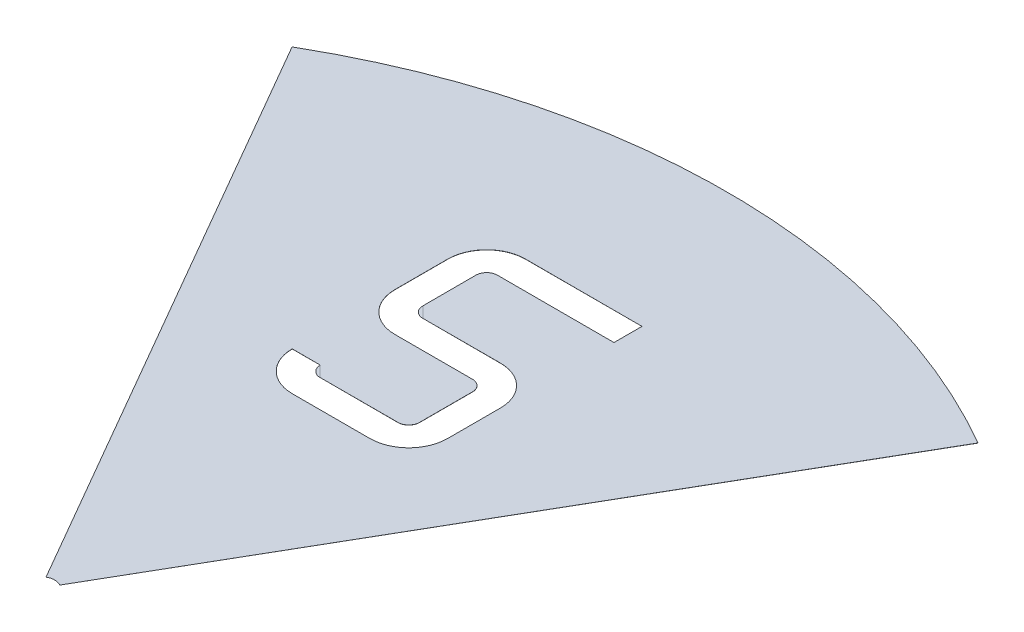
ISO-10303-21;
HEADER;
FILE_DESCRIPTION(('STEP AP214'),'2;1');
FILE_NAME('part.step','',(''),(''),'','','');
FILE_SCHEMA(('AUTOMOTIVE_DESIGN { 1 0 10303 214 1 1 1 1 }'));
ENDSEC;
DATA;
#1=APPLICATION_CONTEXT('core data for automotive mechanical design processes');
#2=APPLICATION_PROTOCOL_DEFINITION('international standard','automotive_design',2000,#1);
#3=PRODUCT_CONTEXT('',#1,'mechanical');
#4=PRODUCT('Part','Part','',(#3));
#5=PRODUCT_RELATED_PRODUCT_CATEGORY('part','',(#4));
#6=PRODUCT_DEFINITION_FORMATION('','',#4);
#7=PRODUCT_DEFINITION_CONTEXT('part definition',#1,'design');
#8=PRODUCT_DEFINITION('design','',#6,#7);
#9=PRODUCT_DEFINITION_SHAPE('','',#8);
#10=(LENGTH_UNIT() NAMED_UNIT(*) SI_UNIT(.MILLI.,.METRE.));
#11=(NAMED_UNIT(*) PLANE_ANGLE_UNIT() SI_UNIT($,.RADIAN.));
#12=(NAMED_UNIT(*) SI_UNIT($,.STERADIAN.) SOLID_ANGLE_UNIT());
#13=UNCERTAINTY_MEASURE_WITH_UNIT(LENGTH_MEASURE(1.E-05),#10,'distance_accuracy_value','');
#14=(GEOMETRIC_REPRESENTATION_CONTEXT(3) GLOBAL_UNCERTAINTY_ASSIGNED_CONTEXT((#13)) GLOBAL_UNIT_ASSIGNED_CONTEXT((#10,
#11,#12)) REPRESENTATION_CONTEXT('',''));
#15=CARTESIAN_POINT('',(0.,0.,0.));
#16=DIRECTION('',(0.,0.,1.));
#17=DIRECTION('',(1.,0.,0.));
#18=AXIS2_PLACEMENT_3D('',#15,#16,#17);
#19=CARTESIAN_POINT('',(-7.58357429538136,-12.0316889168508,12.1826945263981));
#20=DIRECTION('',(0.,1.,0.));
#21=DIRECTION('',(0.,0.,1.));
#22=AXIS2_PLACEMENT_3D('',#19,#20,#21);
#23=PLANE('',#22);
#24=DIRECTION('',(-1.,0.,0.));
#25=VECTOR('',#24,1.);
#26=CARTESIAN_POINT('',(-10.6852133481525,-12.0316889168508,-18.7552632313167));
#27=LINE('',#26,#25);
#28=CARTESIAN_POINT('',(-5.02421334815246,-12.0316889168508,-18.7552632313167));
#29=VERTEX_POINT('',#28);
#30=CARTESIAN_POINT('',(-10.6852133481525,-12.0366889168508,-18.7552632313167));
#31=VERTEX_POINT('',#30);
#32=EDGE_CURVE('E472',#29,#31,#27,.T.);
#33=ORIENTED_EDGE('',*,*,#32,.F.);
#34=CARTESIAN_POINT('',(-5.02421334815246,-12.0316889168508,-15.9247632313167));
#35=DIRECTION('',(0.,1.,0.));
#36=DIRECTION('',(0.,0.,1.));
#37=AXIS2_PLACEMENT_3D('',#34,#35,#36);
#38=CIRCLE('',#37,2.8305);
#39=CARTESIAN_POINT('',(-2.19371334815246,-12.0316889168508,-15.9247632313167));
#40=VERTEX_POINT('',#39);
#41=EDGE_CURVE('E466',#40,#29,#38,.T.);
#42=ORIENTED_EDGE('',*,*,#41,.F.);
#43=DIRECTION('',(0.,0.,-1.));
#44=VECTOR('',#43,1.);
#45=CARTESIAN_POINT('',(-2.19371334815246,-12.0316889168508,-15.9247632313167));
#46=LINE('',#45,#44);
#47=CARTESIAN_POINT('',(-2.19371334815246,-12.0316889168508,-12.0657632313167));
#48=VERTEX_POINT('',#47);
#49=EDGE_CURVE('E500',#48,#40,#46,.T.);
#50=ORIENTED_EDGE('',*,*,#49,.F.);
#51=CARTESIAN_POINT('',(-5.02421334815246,-12.0316889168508,-12.0657632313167));
#52=DIRECTION('',(0.,1.,0.));
#53=DIRECTION('',(0.,0.,1.));
#54=AXIS2_PLACEMENT_3D('',#51,#52,#53);
#55=CIRCLE('',#54,2.8305);
#56=CARTESIAN_POINT('',(-5.02421334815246,-12.0316889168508,-9.23526323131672));
#57=VERTEX_POINT('',#56);
#58=EDGE_CURVE('E494',#57,#48,#55,.T.);
#59=ORIENTED_EDGE('',*,*,#58,.F.);
#60=DIRECTION('',(1.,0.,0.));
#61=VECTOR('',#60,1.);
#62=CARTESIAN_POINT('',(-5.02421334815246,-12.0316889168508,-9.23526323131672));
#63=LINE('',#62,#61);
#64=CARTESIAN_POINT('',(-10.6852133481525,-12.0316889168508,-9.23526323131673));
#65=VERTEX_POINT('',#64);
#66=EDGE_CURVE('E488',#65,#57,#63,.T.);
#67=ORIENTED_EDGE('',*,*,#66,.F.);
#68=CARTESIAN_POINT('',(-10.6852133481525,-12.0316889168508,-12.0657632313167));
#69=DIRECTION('',(0.,1.,0.));
#70=DIRECTION('',(0.,0.,1.));
#71=AXIS2_PLACEMENT_3D('',#68,#69,#70);
#72=CIRCLE('',#71,2.8305);
#73=CARTESIAN_POINT('',(-13.5157133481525,-12.0316889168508,-12.0657632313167));
#74=VERTEX_POINT('',#73);
#75=EDGE_CURVE('E480',#74,#65,#72,.T.);
#76=ORIENTED_EDGE('',*,*,#75,.F.);
#77=DIRECTION('',(-1.,0.,0.));
#78=VECTOR('',#77,1.);
#79=CARTESIAN_POINT('',(-13.5157133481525,-12.0316889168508,-12.0657632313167));
#80=LINE('',#79,#78);
#81=CARTESIAN_POINT('',(-11.4757133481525,-12.0366889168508,-12.0657632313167));
#82=VERTEX_POINT('',#81);
#83=EDGE_CURVE('E475',#82,#74,#80,.T.);
#84=ORIENTED_EDGE('',*,*,#83,.F.);
#85=CARTESIAN_POINT('',(-10.6852133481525,-12.0416889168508,-11.2752632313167));
#86=CARTESIAN_POINT('',(-11.0161490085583,-12.0416889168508,-11.276599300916));
#87=CARTESIAN_POINT('',(-11.2441812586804,-12.0416889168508,-11.5067953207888));
#88=CARTESIAN_POINT('',(-11.4743949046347,-12.0416889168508,-11.7391934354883));
#89=CARTESIAN_POINT('',(-11.4757133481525,-12.0416889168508,-12.0657632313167));
#90=B_SPLINE_CURVE_WITH_KNOTS('',2,(#85,#86,#87,#88,#89),.UNSPECIFIED.,.F.,.F.,(3,2,3),(0.,0.5,
1.),.UNSPECIFIED.);
#91=CARTESIAN_POINT('',(-10.6852133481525,-12.0366889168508,-11.2752632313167));
#92=VERTEX_POINT('',#91);
#93=EDGE_CURVE('E235',#92,#82,#90,.T.);
#94=ORIENTED_EDGE('',*,*,#93,.F.);
#95=DIRECTION('',(-1.,0.,0.));
#96=VECTOR('',#95,1.);
#97=CARTESIAN_POINT('',(-10.6852133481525,-12.0316889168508,-11.2752632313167));
#98=LINE('',#97,#96);
#99=CARTESIAN_POINT('',(-5.02421334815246,-12.0316889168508,-11.2752632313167));
#100=VERTEX_POINT('',#99);
#101=EDGE_CURVE('E427',#100,#92,#98,.T.);
#102=ORIENTED_EDGE('',*,*,#101,.F.);
#103=CARTESIAN_POINT('',(-5.02421334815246,-12.0316889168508,-12.0657632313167));
#104=DIRECTION('',(0.,-1.,0.));
#105=DIRECTION('',(0.,0.,1.));
#106=AXIS2_PLACEMENT_3D('',#103,#104,#105);
#107=CIRCLE('',#106,0.7905);
#108=CARTESIAN_POINT('',(-4.23371334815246,-12.0316889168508,-12.0657632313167));
#109=VERTEX_POINT('',#108);
#110=EDGE_CURVE('E421',#109,#100,#107,.T.);
#111=ORIENTED_EDGE('',*,*,#110,.F.);
#112=DIRECTION('',(0.,0.,1.));
#113=VECTOR('',#112,1.);
#114=CARTESIAN_POINT('',(-4.23371334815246,-12.0316889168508,-12.0657632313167));
#115=LINE('',#114,#113);
#116=CARTESIAN_POINT('',(-4.23371334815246,-12.0316889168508,-15.9247632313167));
#117=VERTEX_POINT('',#116);
#118=EDGE_CURVE('E431',#117,#109,#115,.T.);
#119=ORIENTED_EDGE('',*,*,#118,.F.);
#120=CARTESIAN_POINT('',(-5.02421334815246,-12.0316889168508,-15.9247632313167));
#121=DIRECTION('',(0.,-1.,0.));
#122=DIRECTION('',(0.,0.,1.));
#123=AXIS2_PLACEMENT_3D('',#120,#121,#122);
#124=CIRCLE('',#123,0.7905);
#125=CARTESIAN_POINT('',(-5.02421334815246,-12.0316889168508,-16.7152632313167));
#126=VERTEX_POINT('',#125);
#127=EDGE_CURVE('E436',#126,#117,#124,.T.);
#128=ORIENTED_EDGE('',*,*,#127,.F.);
#129=DIRECTION('',(1.,0.,0.));
#130=VECTOR('',#129,1.);
#131=CARTESIAN_POINT('',(-5.02421334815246,-12.0316889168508,-16.7152632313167));
#132=LINE('',#131,#130);
#133=CARTESIAN_POINT('',(-10.6852133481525,-12.0316889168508,-16.7152632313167));
#134=VERTEX_POINT('',#133);
#135=EDGE_CURVE('E441',#134,#126,#132,.T.);
#136=ORIENTED_EDGE('',*,*,#135,.F.);
#137=CARTESIAN_POINT('',(-10.6852133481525,-12.0316889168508,-19.5457632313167));
#138=DIRECTION('',(0.,1.,0.));
#139=DIRECTION('',(0.,0.,1.));
#140=AXIS2_PLACEMENT_3D('',#137,#138,#139);
#141=CIRCLE('',#140,2.8305);
#142=CARTESIAN_POINT('',(-13.5157133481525,-12.0316889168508,-19.5457632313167));
#143=VERTEX_POINT('',#142);
#144=EDGE_CURVE('E446',#143,#134,#141,.T.);
#145=ORIENTED_EDGE('',*,*,#144,.F.);
#146=DIRECTION('',(0.,0.,1.));
#147=VECTOR('',#146,1.);
#148=CARTESIAN_POINT('',(-13.5157133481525,-12.0316889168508,-19.5457632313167));
#149=LINE('',#148,#147);
#150=CARTESIAN_POINT('',(-13.5157133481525,-12.0316889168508,-23.4047632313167));
#151=VERTEX_POINT('',#150);
#152=EDGE_CURVE('E451',#151,#143,#149,.T.);
#153=ORIENTED_EDGE('',*,*,#152,.F.);
#154=CARTESIAN_POINT('',(-10.6852133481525,-12.0316889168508,-23.4047632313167));
#155=DIRECTION('',(0.,1.,0.));
#156=DIRECTION('',(0.,0.,1.));
#157=AXIS2_PLACEMENT_3D('',#154,#155,#156);
#158=CIRCLE('',#157,2.8305);
#159=CARTESIAN_POINT('',(-10.6852133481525,-12.0316889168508,-26.2352632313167));
#160=VERTEX_POINT('',#159);
#161=EDGE_CURVE('E456',#160,#151,#158,.T.);
#162=ORIENTED_EDGE('',*,*,#161,.F.);
#163=DIRECTION('',(-1.,0.,0.));
#164=VECTOR('',#163,1.);
#165=CARTESIAN_POINT('',(-10.6852133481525,-12.0316889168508,-26.2352632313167));
#166=LINE('',#165,#164);
#167=CARTESIAN_POINT('',(-2.19371334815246,-12.036688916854,-26.2352631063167));
#168=VERTEX_POINT('',#167);
#169=EDGE_CURVE('E453',#168,#160,#166,.T.);
#170=ORIENTED_EDGE('',*,*,#169,.F.);
#171=CARTESIAN_POINT('',(-2.19371334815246,-12.0416889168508,-24.1952632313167));
#172=DIRECTION('',(0.,0.,-1.));
#173=VECTOR('',#172,1.);
#174=LINE('',#171,#173);
#175=CARTESIAN_POINT('',(-2.19371347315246,-12.036688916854,-24.1952632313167));
#176=VERTEX_POINT('',#175);
#177=EDGE_CURVE('E311',#176,#168,#174,.T.);
#178=ORIENTED_EDGE('',*,*,#177,.F.);
#179=DIRECTION('',(1.,0.,0.));
#180=VECTOR('',#179,1.);
#181=CARTESIAN_POINT('',(-2.19371334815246,-12.0316889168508,-24.1952632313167));
#182=LINE('',#181,#180);
#183=CARTESIAN_POINT('',(-10.6852133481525,-12.0316889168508,-24.1952632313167));
#184=VERTEX_POINT('',#183);
#185=EDGE_CURVE('E173',#184,#176,#182,.T.);
#186=ORIENTED_EDGE('',*,*,#185,.F.);
#187=CARTESIAN_POINT('',(-10.6852133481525,-12.0316889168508,-23.4047632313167));
#188=DIRECTION('',(0.,-1.,0.));
#189=DIRECTION('',(0.,0.,1.));
#190=AXIS2_PLACEMENT_3D('',#187,#188,#189);
#191=CIRCLE('',#190,0.7905);
#192=CARTESIAN_POINT('',(-11.4757133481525,-12.0316889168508,-23.4047632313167));
#193=VERTEX_POINT('',#192);
#194=EDGE_CURVE('E170',#193,#184,#191,.T.);
#195=ORIENTED_EDGE('',*,*,#194,.F.);
#196=DIRECTION('',(0.,0.,-1.));
#197=VECTOR('',#196,1.);
#198=CARTESIAN_POINT('',(-11.4757133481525,-12.0316889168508,-23.4047632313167));
#199=LINE('',#198,#197);
#200=CARTESIAN_POINT('',(-11.4757133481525,-12.0366889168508,-19.5457632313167));
#201=VERTEX_POINT('',#200);
#202=EDGE_CURVE('E162',#201,#193,#199,.T.);
#203=ORIENTED_EDGE('',*,*,#202,.F.);
#204=CARTESIAN_POINT('',(-10.6852133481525,-12.0416889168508,-18.7552632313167));
#205=CARTESIAN_POINT('',(-11.0161490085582,-12.0416889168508,-18.756599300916));
#206=CARTESIAN_POINT('',(-11.2441812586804,-12.0416889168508,-18.9867953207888));
#207=CARTESIAN_POINT('',(-11.4743949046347,-12.0416889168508,-19.2191934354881));
#208=CARTESIAN_POINT('',(-11.4757133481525,-12.0416889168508,-19.5457632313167));
#209=B_SPLINE_CURVE_WITH_KNOTS('',2,(#204,#205,#206,#207,#208),.UNSPECIFIED.,.F.,.F.,(3,2,3),
(0.,0.5,1.),.UNSPECIFIED.);
#210=EDGE_CURVE('E167',#31,#201,#209,.T.);
#211=ORIENTED_EDGE('',*,*,#210,.F.);
#212=EDGE_LOOP('',(#33,#42,#50,#59,#67,#76,#84,#94,#102,#111,#119,#128,#136,#145,#153,#162,#170,
#178,#186,#195,#203,#211));
#213=FACE_BOUND('',#212,.T.);
#214=CARTESIAN_POINT('',(-8.08357429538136,-12.0316889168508,11.3166691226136));
#215=CARTESIAN_POINT('',(-7.84857608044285,-12.0316889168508,11.1818850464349));
#216=CARTESIAN_POINT('',(-7.58357429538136,-12.0316889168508,11.1826945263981));
#217=CARTESIAN_POINT('',(-7.31573471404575,-12.0316889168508,11.1835126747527));
#218=CARTESIAN_POINT('',(-7.08357429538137,-12.0316889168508,11.3166691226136));
#219=B_SPLINE_CURVE_WITH_KNOTS('',2,(#214,#215,#216,#217,#218),.UNSPECIFIED.,.F.,.F.,(3,2,3),
(0.,0.5,1.),.UNSPECIFIED.);
#220=CARTESIAN_POINT('',(-8.08357429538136,-12.0366889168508,11.3166691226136));
#221=VERTEX_POINT('',#220);
#222=CARTESIAN_POINT('',(-7.08357429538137,-12.0366889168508,11.3166691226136));
#223=VERTEX_POINT('',#222);
#224=EDGE_CURVE('E26',#221,#223,#219,.T.);
#225=ORIENTED_EDGE('',*,*,#224,.T.);
#226=DIRECTION('',(0.499999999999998,0.,-0.86602540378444));
#227=VECTOR('',#226,1.);
#228=CARTESIAN_POINT('',(-7.08357429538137,-12.0316889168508,11.3166691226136));
#229=LINE('',#228,#227);
#230=CARTESIAN_POINT('',(17.4164257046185,-12.0316889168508,-31.1185756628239));
#231=VERTEX_POINT('',#230);
#232=EDGE_CURVE('E191',#223,#231,#229,.T.);
#233=ORIENTED_EDGE('',*,*,#232,.T.);
#234=CARTESIAN_POINT('',(-7.58357429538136,-12.0316889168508,12.1826945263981));
#235=DIRECTION('',(0.,1.,0.));
#236=DIRECTION('',(0.,0.,1.));
#237=AXIS2_PLACEMENT_3D('',#234,#235,#236);
#238=CIRCLE('',#237,50.);
#239=CARTESIAN_POINT('',(-32.5835742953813,-12.0316889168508,-31.1185756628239));
#240=VERTEX_POINT('',#239);
#241=EDGE_CURVE('E355',#231,#240,#238,.T.);
#242=ORIENTED_EDGE('',*,*,#241,.T.);
#243=DIRECTION('',(0.499999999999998,0.,0.86602540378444));
#244=VECTOR('',#243,1.);
#245=CARTESIAN_POINT('',(-8.08357429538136,-12.0316889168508,11.3166691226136));
#246=LINE('',#245,#244);
#247=EDGE_CURVE('E354',#240,#221,#246,.T.);
#248=ORIENTED_EDGE('',*,*,#247,.T.);
#249=EDGE_LOOP('',(#225,#233,#242,#248));
#250=FACE_BOUND('',#249,.T.);
#251=ADVANCED_FACE('F14',(#213,#250),#23,.T.);
#252=CARTESIAN_POINT('',(-5.02421334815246,-22.0316889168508,-15.9247632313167));
#253=DIRECTION('',(0.,1.,0.));
#254=DIRECTION('',(0.,0.,1.));
#255=AXIS2_PLACEMENT_3D('',#252,#253,#254);
#256=CYLINDRICAL_SURFACE('',#255,2.8305);
#257=DIRECTION('',(0.,1.,0.));
#258=VECTOR('',#257,1.);
#259=CARTESIAN_POINT('',(-2.19371334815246,-22.0316889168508,-15.9247632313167));
#260=LINE('',#259,#258);
#261=CARTESIAN_POINT('',(-2.19371334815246,-12.0416889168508,-15.9247632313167));
#262=VERTEX_POINT('',#261);
#263=EDGE_CURVE('E469',#262,#40,#260,.T.);
#264=ORIENTED_EDGE('',*,*,#263,.T.);
#265=ORIENTED_EDGE('',*,*,#41,.T.);
#266=DIRECTION('',(0.,1.,0.));
#267=VECTOR('',#266,1.);
#268=CARTESIAN_POINT('',(-5.02421334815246,-22.0316889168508,-18.7552632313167));
#269=LINE('',#268,#267);
#270=CARTESIAN_POINT('',(-5.02421334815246,-12.0416889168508,-18.7552632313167));
#271=VERTEX_POINT('',#270);
#272=EDGE_CURVE('E468',#271,#29,#269,.T.);
#273=ORIENTED_EDGE('',*,*,#272,.F.);
#274=CARTESIAN_POINT('',(-2.19371334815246,-12.0416889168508,-15.9247632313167));
#275=CARTESIAN_POINT('',(-2.19376143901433,-12.0416889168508,-16.1849736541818));
#276=CARTESIAN_POINT('',(-2.24096750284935,-12.0416889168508,-16.4398096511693));
#277=CARTESIAN_POINT('',(-2.29122395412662,-12.0416889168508,-16.7111127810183));
#278=CARTESIAN_POINT('',(-2.39244756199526,-12.0416889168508,-16.9666553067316));
#279=CARTESIAN_POINT('',(-2.49831913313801,-12.0416889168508,-17.2339317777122));
#280=CARTESIAN_POINT('',(-2.65509755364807,-12.0416889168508,-17.4736404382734));
#281=CARTESIAN_POINT('',(-2.8158158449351,-12.0416889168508,-17.7193730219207));
#282=CARTESIAN_POINT('',(-3.02274760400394,-12.0416889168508,-17.9262289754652));
#283=CARTESIAN_POINT('',(-3.23040889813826,-12.0416889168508,-18.1338141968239));
#284=CARTESIAN_POINT('',(-3.47533614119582,-12.0416889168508,-18.2938790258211));
#285=CARTESIAN_POINT('',(-3.71598539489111,-12.0416889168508,-18.45114810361));
#286=CARTESIAN_POINT('',(-3.98232127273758,-12.0416889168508,-18.5565290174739));
#287=CARTESIAN_POINT('',(-4.23888642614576,-12.0416889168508,-18.6580439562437));
#288=CARTESIAN_POINT('',(-4.50916692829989,-12.0416889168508,-18.7080090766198));
#289=CARTESIAN_POINT('',(-4.76452315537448,-12.0416889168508,-18.7552152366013));
#290=CARTESIAN_POINT('',(-5.02421334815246,-12.0416889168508,-18.7552632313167));
#291=B_SPLINE_CURVE_WITH_KNOTS('',2,(#274,#275,#276,#277,#278,#279,#280,#281,#282,#283,#284,
#285,#286,#287,#288,#289,#290),.UNSPECIFIED.,.F.,.F.,(3,2,2,2,2,2,2,2,3),(0.,0.125,0.25,0.375,
0.5,0.625,0.75,0.875,1.),.UNSPECIFIED.);
#292=EDGE_CURVE('E550',#262,#271,#291,.T.);
#293=ORIENTED_EDGE('',*,*,#292,.F.);
#294=EDGE_LOOP('',(#264,#265,#273,#293));
#295=FACE_BOUND('',#294,.T.);
#296=ADVANCED_FACE('F205',(#295),#256,.F.);
#297=CARTESIAN_POINT('',(-2.19371334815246,-22.0316889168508,-15.9247632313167));
#298=DIRECTION('',(1.,0.,0.));
#299=DIRECTION('',(0.,0.,-1.));
#300=AXIS2_PLACEMENT_3D('',#297,#298,#299);
#301=PLANE('',#300);
#302=DIRECTION('',(0.,1.,0.));
#303=VECTOR('',#302,1.);
#304=CARTESIAN_POINT('',(-2.19371334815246,-22.0316889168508,-12.0657632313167));
#305=LINE('',#304,#303);
#306=CARTESIAN_POINT('',(-2.19371334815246,-12.0416889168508,-12.0657632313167));
#307=VERTEX_POINT('',#306);
#308=EDGE_CURVE('E503',#307,#48,#305,.T.);
#309=ORIENTED_EDGE('',*,*,#308,.T.);
#310=ORIENTED_EDGE('',*,*,#49,.T.);
#311=ORIENTED_EDGE('',*,*,#263,.F.);
#312=CARTESIAN_POINT('',(-2.19371334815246,-12.0416889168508,-12.0657632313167));
#313=CARTESIAN_POINT('',(-2.19371334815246,-12.0416889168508,-15.9247632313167));
#314=B_SPLINE_CURVE_WITH_KNOTS('',1,(#312,#313),.UNSPECIFIED.,.F.,.F.,(2,2),(0.,1.),.UNSPECIFIED.);
#315=EDGE_CURVE('E560',#307,#262,#314,.T.);
#316=ORIENTED_EDGE('',*,*,#315,.F.);
#317=EDGE_LOOP('',(#309,#310,#311,#316));
#318=FACE_BOUND('',#317,.T.);
#319=ADVANCED_FACE('F812',(#318),#301,.F.);
#320=CARTESIAN_POINT('',(-5.02421334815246,-22.0316889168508,-12.0657632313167));
#321=DIRECTION('',(0.,1.,0.));
#322=DIRECTION('',(0.,0.,1.));
#323=AXIS2_PLACEMENT_3D('',#320,#321,#322);
#324=CYLINDRICAL_SURFACE('',#323,2.8305);
#325=DIRECTION('',(0.,1.,0.));
#326=VECTOR('',#325,1.);
#327=CARTESIAN_POINT('',(-5.02421334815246,-22.0316889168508,-9.23526323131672));
#328=LINE('',#327,#326);
#329=CARTESIAN_POINT('',(-5.02421334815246,-12.0416889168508,-9.23526323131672));
#330=VERTEX_POINT('',#329);
#331=EDGE_CURVE('E497',#330,#57,#328,.T.);
#332=ORIENTED_EDGE('',*,*,#331,.T.);
#333=ORIENTED_EDGE('',*,*,#58,.T.);
#334=ORIENTED_EDGE('',*,*,#308,.F.);
#335=CARTESIAN_POINT('',(-5.02421334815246,-12.0416889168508,-9.23526323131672));
#336=CARTESIAN_POINT('',(-4.7640029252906,-12.0416889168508,-9.23531132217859));
#337=CARTESIAN_POINT('',(-4.50916692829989,-12.0416889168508,-9.28251738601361));
#338=CARTESIAN_POINT('',(-4.23786379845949,-12.0416889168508,-9.33277383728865));
#339=CARTESIAN_POINT('',(-3.98232127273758,-12.0416889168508,-9.43399744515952));
#340=CARTESIAN_POINT('',(-3.71504480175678,-12.0416889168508,-9.53986901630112));
#341=CARTESIAN_POINT('',(-3.47533614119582,-12.0416889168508,-9.69664743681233));
#342=CARTESIAN_POINT('',(-3.22960355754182,-12.0416889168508,-9.85736572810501));
#343=CARTESIAN_POINT('',(-3.02274760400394,-12.0416889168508,-10.0642974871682));
#344=CARTESIAN_POINT('',(-2.81516238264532,-12.0416889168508,-10.2719587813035));
#345=CARTESIAN_POINT('',(-2.65509755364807,-12.0416889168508,-10.5168860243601));
#346=CARTESIAN_POINT('',(-2.49782847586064,-12.0416889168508,-10.7575352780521));
#347=CARTESIAN_POINT('',(-2.39244756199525,-12.0416889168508,-11.0238711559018));
#348=CARTESIAN_POINT('',(-2.29093262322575,-12.0416889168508,-11.2804363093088));
#349=CARTESIAN_POINT('',(-2.24096750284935,-12.0416889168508,-11.5507168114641));
#350=CARTESIAN_POINT('',(-2.19376134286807,-12.0416889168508,-11.8060730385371));
#351=CARTESIAN_POINT('',(-2.19371334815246,-12.0416889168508,-12.0657632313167));
#352=B_SPLINE_CURVE_WITH_KNOTS('',2,(#335,#336,#337,#338,#339,#340,#341,#342,#343,#344,#345,
#346,#347,#348,#349,#350,#351),.UNSPECIFIED.,.F.,.F.,(3,2,2,2,2,2,2,2,3),(0.,0.125,0.25,0.375,
0.5,0.625,0.75,0.875,1.),.UNSPECIFIED.);
#353=EDGE_CURVE('E534',#330,#307,#352,.T.);
#354=ORIENTED_EDGE('',*,*,#353,.F.);
#355=EDGE_LOOP('',(#332,#333,#334,#354));
#356=FACE_BOUND('',#355,.T.);
#357=ADVANCED_FACE('F584',(#356),#324,.F.);
#358=CARTESIAN_POINT('',(-5.02421334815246,-22.0316889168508,-9.23526323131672));
#359=DIRECTION('',(0.,0.,1.));
#360=DIRECTION('',(1.,0.,0.));
#361=AXIS2_PLACEMENT_3D('',#358,#359,#360);
#362=PLANE('',#361);
#363=DIRECTION('',(0.,1.,0.));
#364=VECTOR('',#363,1.);
#365=CARTESIAN_POINT('',(-10.6852133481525,-22.0316889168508,-9.23526323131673));
#366=LINE('',#365,#364);
#367=CARTESIAN_POINT('',(-10.6852133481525,-12.0416889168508,-9.23526323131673));
#368=VERTEX_POINT('',#367);
#369=EDGE_CURVE('E491',#368,#65,#366,.T.);
#370=ORIENTED_EDGE('',*,*,#369,.T.);
#371=ORIENTED_EDGE('',*,*,#66,.T.);
#372=ORIENTED_EDGE('',*,*,#331,.F.);
#373=CARTESIAN_POINT('',(-10.6852133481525,-12.0416889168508,-9.23526323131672));
#374=CARTESIAN_POINT('',(-5.02421334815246,-12.0416889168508,-9.23526323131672));
#375=B_SPLINE_CURVE_WITH_KNOTS('',1,(#373,#374),.UNSPECIFIED.,.F.,.F.,(2,2),(0.,1.),.UNSPECIFIED.);
#376=EDGE_CURVE('E254',#368,#330,#375,.T.);
#377=ORIENTED_EDGE('',*,*,#376,.F.);
#378=EDGE_LOOP('',(#370,#371,#372,#377));
#379=FACE_BOUND('',#378,.T.);
#380=ADVANCED_FACE('F582',(#379),#362,.F.);
#381=CARTESIAN_POINT('',(-10.6852133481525,-22.0316889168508,-12.0657632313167));
#382=DIRECTION('',(0.,1.,0.));
#383=DIRECTION('',(0.,0.,1.));
#384=AXIS2_PLACEMENT_3D('',#381,#382,#383);
#385=CYLINDRICAL_SURFACE('',#384,2.8305);
#386=DIRECTION('',(0.,1.,0.));
#387=VECTOR('',#386,1.);
#388=CARTESIAN_POINT('',(-13.5157133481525,-22.0316889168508,-12.0657632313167));
#389=LINE('',#388,#387);
#390=CARTESIAN_POINT('',(-13.5157133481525,-12.0416889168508,-12.0657632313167));
#391=VERTEX_POINT('',#390);
#392=EDGE_CURVE('E485',#391,#74,#389,.T.);
#393=ORIENTED_EDGE('',*,*,#392,.T.);
#394=ORIENTED_EDGE('',*,*,#75,.T.);
#395=ORIENTED_EDGE('',*,*,#369,.F.);
#396=CARTESIAN_POINT('',(-13.5157133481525,-12.0416889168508,-12.0657632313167));
#397=CARTESIAN_POINT('',(-13.515665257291,-12.0416889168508,-11.8055528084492));
#398=CARTESIAN_POINT('',(-13.4684591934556,-12.0416889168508,-11.5507168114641));
#399=CARTESIAN_POINT('',(-13.4182027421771,-12.0416889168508,-11.2794136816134));
#400=CARTESIAN_POINT('',(-13.3169791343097,-12.0416889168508,-11.0238711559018));
#401=CARTESIAN_POINT('',(-13.2111075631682,-12.0416889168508,-10.756594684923));
#402=CARTESIAN_POINT('',(-13.0543291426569,-12.0416889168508,-10.5168860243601));
#403=CARTESIAN_POINT('',(-12.8936108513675,-12.0416889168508,-10.2711534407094));
#404=CARTESIAN_POINT('',(-12.686679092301,-12.0416889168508,-10.0642974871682));
#405=CARTESIAN_POINT('',(-12.4790177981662,-12.0416889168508,-9.85671226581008));
#406=CARTESIAN_POINT('',(-12.2340905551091,-12.0416889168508,-9.69664743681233));
#407=CARTESIAN_POINT('',(-11.9934413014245,-12.0416889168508,-9.53937835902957));
#408=CARTESIAN_POINT('',(-11.7271054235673,-12.0416889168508,-9.43399744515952));
#409=CARTESIAN_POINT('',(-11.4705402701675,-12.0416889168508,-9.33248250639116));
#410=CARTESIAN_POINT('',(-11.200259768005,-12.0416889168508,-9.28251738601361));
#411=CARTESIAN_POINT('',(-10.9449035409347,-12.0416889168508,-9.23531122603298));
#412=CARTESIAN_POINT('',(-10.6852133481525,-12.0416889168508,-9.23526323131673));
#413=B_SPLINE_CURVE_WITH_KNOTS('',2,(#396,#397,#398,#399,#400,#401,#402,#403,#404,#405,#406,
#407,#408,#409,#410,#411,#412),.UNSPECIFIED.,.F.,.F.,(3,2,2,2,2,2,2,2,3),(0.,0.125,0.25,0.375,
0.5,0.625,0.75,0.875,1.),.UNSPECIFIED.);
#414=EDGE_CURVE('E252',#391,#368,#413,.T.);
#415=ORIENTED_EDGE('',*,*,#414,.F.);
#416=EDGE_LOOP('',(#393,#394,#395,#415));
#417=FACE_BOUND('',#416,.T.);
#418=ADVANCED_FACE('F604',(#417),#385,.F.);
#419=CARTESIAN_POINT('',(-13.5157133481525,-22.0316889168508,-12.0657632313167));
#420=DIRECTION('',(0.,0.,-1.));
#421=DIRECTION('',(-1.,0.,0.));
#422=AXIS2_PLACEMENT_3D('',#419,#420,#421);
#423=PLANE('',#422);
#424=ORIENTED_EDGE('',*,*,#83,.T.);
#425=ORIENTED_EDGE('',*,*,#392,.F.);
#426=CARTESIAN_POINT('',(-11.4757133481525,-12.0416889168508,-12.0657632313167));
#427=CARTESIAN_POINT('',(-13.5157133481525,-12.0416889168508,-12.0657632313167));
#428=B_SPLINE_CURVE_WITH_KNOTS('',1,(#426,#427),.UNSPECIFIED.,.F.,.F.,(2,2),(0.,1.),.UNSPECIFIED.);
#429=EDGE_CURVE('E245',#82,#391,#428,.T.);
#430=ORIENTED_EDGE('',*,*,#429,.F.);
#431=EDGE_LOOP('',(#424,#425,#430));
#432=FACE_BOUND('',#431,.T.);
#433=ADVANCED_FACE('F614',(#432),#423,.F.);
#434=CARTESIAN_POINT('',(-10.6852133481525,-22.0316889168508,-18.7552632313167));
#435=DIRECTION('',(0.,0.,-1.));
#436=DIRECTION('',(-1.,0.,0.));
#437=AXIS2_PLACEMENT_3D('',#434,#435,#436);
#438=PLANE('',#437);
#439=ORIENTED_EDGE('',*,*,#272,.T.);
#440=ORIENTED_EDGE('',*,*,#32,.T.);
#441=CARTESIAN_POINT('',(-5.02421334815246,-12.0416889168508,-18.7552632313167));
#442=CARTESIAN_POINT('',(-10.6852133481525,-12.0416889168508,-18.7552632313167));
#443=B_SPLINE_CURVE_WITH_KNOTS('',1,(#441,#442),.UNSPECIFIED.,.F.,.F.,(2,2),(0.,1.),.UNSPECIFIED.);
#444=EDGE_CURVE('E190',#271,#31,#443,.T.);
#445=ORIENTED_EDGE('',*,*,#444,.F.);
#446=EDGE_LOOP('',(#439,#440,#445));
#447=FACE_BOUND('',#446,.T.);
#448=ADVANCED_FACE('F618',(#447),#438,.F.);
#449=CARTESIAN_POINT('',(-10.6852133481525,-22.0316889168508,-23.4047632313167));
#450=DIRECTION('',(0.,1.,0.));
#451=DIRECTION('',(0.,0.,1.));
#452=AXIS2_PLACEMENT_3D('',#449,#450,#451);
#453=CYLINDRICAL_SURFACE('',#452,2.8305);
#454=DIRECTION('',(0.,1.,0.));
#455=VECTOR('',#454,1.);
#456=CARTESIAN_POINT('',(-10.6852133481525,-22.0316889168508,-26.2352632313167));
#457=LINE('',#456,#455);
#458=CARTESIAN_POINT('',(-10.6852133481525,-12.0416889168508,-26.2352632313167));
#459=VERTEX_POINT('',#458);
#460=EDGE_CURVE('E459',#459,#160,#457,.T.);
#461=ORIENTED_EDGE('',*,*,#460,.T.);
#462=ORIENTED_EDGE('',*,*,#161,.T.);
#463=DIRECTION('',(0.,1.,0.));
#464=VECTOR('',#463,1.);
#465=CARTESIAN_POINT('',(-13.5157133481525,-22.0316889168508,-23.4047632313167));
#466=LINE('',#465,#464);
#467=CARTESIAN_POINT('',(-13.5157133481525,-12.0416889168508,-23.4047632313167));
#468=VERTEX_POINT('',#467);
#469=EDGE_CURVE('E458',#468,#151,#466,.T.);
#470=ORIENTED_EDGE('',*,*,#469,.F.);
#471=CARTESIAN_POINT('',(-10.6852133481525,-12.0416889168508,-26.2352632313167));
#472=CARTESIAN_POINT('',(-10.9454237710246,-12.0416889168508,-26.2352151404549));
#473=CARTESIAN_POINT('',(-11.200259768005,-12.0416889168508,-26.1880090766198));
#474=CARTESIAN_POINT('',(-11.47156289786,-12.0416889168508,-26.1377526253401));
#475=CARTESIAN_POINT('',(-11.7271054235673,-12.0416889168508,-26.0365290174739));
#476=CARTESIAN_POINT('',(-11.9943818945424,-12.0416889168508,-25.9306574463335));
#477=CARTESIAN_POINT('',(-12.2340905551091,-12.0416889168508,-25.7738790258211));
#478=CARTESIAN_POINT('',(-12.4798231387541,-12.0416889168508,-25.613160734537));
#479=CARTESIAN_POINT('',(-12.686679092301,-12.0416889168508,-25.4062289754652));
#480=CARTESIAN_POINT('',(-12.8942643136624,-12.0416889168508,-25.1985676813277));
#481=CARTESIAN_POINT('',(-13.0543291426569,-12.0416889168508,-24.9536404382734));
#482=CARTESIAN_POINT('',(-13.2115982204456,-12.0416889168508,-24.7129911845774));
#483=CARTESIAN_POINT('',(-13.3169791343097,-12.0416889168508,-24.4466553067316));
#484=CARTESIAN_POINT('',(-13.4184940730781,-12.0416889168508,-24.1900901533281));
#485=CARTESIAN_POINT('',(-13.4684591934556,-12.0416889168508,-23.9198096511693));
#486=CARTESIAN_POINT('',(-13.5156653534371,-12.0416889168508,-23.6644534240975));
#487=CARTESIAN_POINT('',(-13.5157133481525,-12.0416889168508,-23.4047632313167));
#488=B_SPLINE_CURVE_WITH_KNOTS('',2,(#471,#472,#473,#474,#475,#476,#477,#478,#479,#480,#481,
#482,#483,#484,#485,#486,#487),.UNSPECIFIED.,.F.,.F.,(3,2,2,2,2,2,2,2,3),(0.,0.125,0.25,0.375,
0.5,0.625,0.75,0.875,1.),.UNSPECIFIED.);
#489=EDGE_CURVE('E300',#459,#468,#488,.T.);
#490=ORIENTED_EDGE('',*,*,#489,.F.);
#491=EDGE_LOOP('',(#461,#462,#470,#490));
#492=FACE_BOUND('',#491,.T.);
#493=ADVANCED_FACE('F622',(#492),#453,.F.);
#494=CARTESIAN_POINT('',(-10.6852133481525,-22.0316889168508,-26.2352632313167));
#495=DIRECTION('',(0.,0.,-1.));
#496=DIRECTION('',(-1.,0.,0.));
#497=AXIS2_PLACEMENT_3D('',#494,#495,#496);
#498=PLANE('',#497);
#499=ORIENTED_EDGE('',*,*,#169,.T.);
#500=ORIENTED_EDGE('',*,*,#460,.F.);
#501=CARTESIAN_POINT('',(-2.19371334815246,-12.0416889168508,-26.2352632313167));
#502=CARTESIAN_POINT('',(-10.6852133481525,-12.0416889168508,-26.2352632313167));
#503=B_SPLINE_CURVE_WITH_KNOTS('',1,(#501,#502),.UNSPECIFIED.,.F.,.F.,(2,2),(0.,1.),.UNSPECIFIED.);
#504=EDGE_CURVE('E305',#168,#459,#503,.T.);
#505=ORIENTED_EDGE('',*,*,#504,.F.);
#506=EDGE_LOOP('',(#499,#500,#505));
#507=FACE_BOUND('',#506,.T.);
#508=ADVANCED_FACE('F627',(#507),#498,.F.);
#509=CARTESIAN_POINT('',(-13.5157133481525,-22.0316889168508,-19.5457632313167));
#510=DIRECTION('',(-1.,0.,0.));
#511=DIRECTION('',(0.,0.,1.));
#512=AXIS2_PLACEMENT_3D('',#509,#510,#511);
#513=PLANE('',#512);
#514=ORIENTED_EDGE('',*,*,#469,.T.);
#515=ORIENTED_EDGE('',*,*,#152,.T.);
#516=DIRECTION('',(0.,1.,0.));
#517=VECTOR('',#516,1.);
#518=CARTESIAN_POINT('',(-13.5157133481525,-22.0316889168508,-19.5457632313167));
#519=LINE('',#518,#517);
#520=CARTESIAN_POINT('',(-13.5157133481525,-12.0416889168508,-19.5457632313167));
#521=VERTEX_POINT('',#520);
#522=EDGE_CURVE('E448',#521,#143,#519,.T.);
#523=ORIENTED_EDGE('',*,*,#522,.F.);
#524=CARTESIAN_POINT('',(-13.5157133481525,-12.0416889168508,-23.4047632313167));
#525=CARTESIAN_POINT('',(-13.5157133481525,-12.0416889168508,-19.5457632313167));
#526=B_SPLINE_CURVE_WITH_KNOTS('',1,(#524,#525),.UNSPECIFIED.,.F.,.F.,(2,2),(0.,1.),.UNSPECIFIED.);
#527=EDGE_CURVE('E294',#468,#521,#526,.T.);
#528=ORIENTED_EDGE('',*,*,#527,.F.);
#529=EDGE_LOOP('',(#514,#515,#523,#528));
#530=FACE_BOUND('',#529,.T.);
#531=ADVANCED_FACE('F679',(#530),#513,.F.);
#532=CARTESIAN_POINT('',(-10.6852133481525,-22.0316889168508,-19.5457632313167));
#533=DIRECTION('',(0.,1.,0.));
#534=DIRECTION('',(0.,0.,1.));
#535=AXIS2_PLACEMENT_3D('',#532,#533,#534);
#536=CYLINDRICAL_SURFACE('',#535,2.8305);
#537=ORIENTED_EDGE('',*,*,#522,.T.);
#538=ORIENTED_EDGE('',*,*,#144,.T.);
#539=DIRECTION('',(0.,1.,0.));
#540=VECTOR('',#539,1.);
#541=CARTESIAN_POINT('',(-10.6852133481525,-22.0316889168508,-16.7152632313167));
#542=LINE('',#541,#540);
#543=CARTESIAN_POINT('',(-10.6852133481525,-12.0416889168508,-16.7152632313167));
#544=VERTEX_POINT('',#543);
#545=EDGE_CURVE('E443',#544,#134,#542,.T.);
#546=ORIENTED_EDGE('',*,*,#545,.F.);
#547=CARTESIAN_POINT('',(-13.5157133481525,-12.0416889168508,-19.5457632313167));
#548=CARTESIAN_POINT('',(-13.515665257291,-12.0416889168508,-19.2855528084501));
#549=CARTESIAN_POINT('',(-13.4684591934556,-12.0416889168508,-19.0307168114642));
#550=CARTESIAN_POINT('',(-13.4182027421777,-12.0416889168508,-18.7594136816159));
#551=CARTESIAN_POINT('',(-13.3169791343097,-12.0416889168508,-18.5038711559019));
#552=CARTESIAN_POINT('',(-13.2111075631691,-12.0416889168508,-18.2365946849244));
#553=CARTESIAN_POINT('',(-13.0543291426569,-12.0416889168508,-17.9968860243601));
#554=CARTESIAN_POINT('',(-12.8936108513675,-12.0416889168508,-17.7511534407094));
#555=CARTESIAN_POINT('',(-12.686679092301,-12.0416889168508,-17.5442974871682));
#556=CARTESIAN_POINT('',(-12.4790177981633,-12.0416889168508,-17.3367122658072));
#557=CARTESIAN_POINT('',(-12.2340905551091,-12.0416889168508,-17.1766474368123));
#558=CARTESIAN_POINT('',(-11.9934413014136,-12.0416889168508,-17.0193783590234));
#559=CARTESIAN_POINT('',(-11.7271054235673,-12.0416889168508,-16.9139974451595));
#560=CARTESIAN_POINT('',(-11.4705402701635,-12.0416889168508,-16.8124825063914));
#561=CARTESIAN_POINT('',(-11.200259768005,-12.0416889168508,-16.7625173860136));
#562=CARTESIAN_POINT('',(-10.9449035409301,-12.0416889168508,-16.7153112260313));
#563=CARTESIAN_POINT('',(-10.6852133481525,-12.0416889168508,-16.7152632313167));
#564=B_SPLINE_CURVE_WITH_KNOTS('',2,(#547,#548,#549,#550,#551,#552,#553,#554,#555,#556,#557,
#558,#559,#560,#561,#562,#563),.UNSPECIFIED.,.F.,.F.,(3,2,2,2,2,2,2,2,3),(0.,0.125,0.25,0.375,
0.5,0.625,0.75,0.875,1.),.UNSPECIFIED.);
#565=EDGE_CURVE('E289',#521,#544,#564,.T.);
#566=ORIENTED_EDGE('',*,*,#565,.F.);
#567=EDGE_LOOP('',(#537,#538,#546,#566));
#568=FACE_BOUND('',#567,.T.);
#569=ADVANCED_FACE('F669',(#568),#536,.F.);
#570=CARTESIAN_POINT('',(-5.02421334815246,-22.0316889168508,-16.7152632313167));
#571=DIRECTION('',(0.,0.,1.));
#572=DIRECTION('',(1.,0.,0.));
#573=AXIS2_PLACEMENT_3D('',#570,#571,#572);
#574=PLANE('',#573);
#575=ORIENTED_EDGE('',*,*,#545,.T.);
#576=ORIENTED_EDGE('',*,*,#135,.T.);
#577=DIRECTION('',(0.,1.,0.));
#578=VECTOR('',#577,1.);
#579=CARTESIAN_POINT('',(-5.02421334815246,-22.0316889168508,-16.7152632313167));
#580=LINE('',#579,#578);
#581=CARTESIAN_POINT('',(-5.02421334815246,-12.0416889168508,-16.7152632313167));
#582=VERTEX_POINT('',#581);
#583=EDGE_CURVE('E438',#582,#126,#580,.T.);
#584=ORIENTED_EDGE('',*,*,#583,.F.);
#585=CARTESIAN_POINT('',(-10.6852133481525,-12.0416889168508,-16.7152632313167));
#586=CARTESIAN_POINT('',(-5.02421334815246,-12.0416889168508,-16.7152632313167));
#587=B_SPLINE_CURVE_WITH_KNOTS('',1,(#585,#586),.UNSPECIFIED.,.F.,.F.,(2,2),(0.,1.),.UNSPECIFIED.);
#588=EDGE_CURVE('E283',#544,#582,#587,.T.);
#589=ORIENTED_EDGE('',*,*,#588,.F.);
#590=EDGE_LOOP('',(#575,#576,#584,#589));
#591=FACE_BOUND('',#590,.T.);
#592=ADVANCED_FACE('F678',(#591),#574,.F.);
#593=CARTESIAN_POINT('',(-5.02421334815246,-22.0316889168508,-15.9247632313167));
#594=DIRECTION('',(0.,1.,0.));
#595=DIRECTION('',(0.,0.,1.));
#596=AXIS2_PLACEMENT_3D('',#593,#594,#595);
#597=CYLINDRICAL_SURFACE('',#596,0.7905);
#598=ORIENTED_EDGE('',*,*,#583,.T.);
#599=ORIENTED_EDGE('',*,*,#127,.T.);
#600=DIRECTION('',(0.,1.,0.));
#601=VECTOR('',#600,1.);
#602=CARTESIAN_POINT('',(-4.23371334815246,-22.0316889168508,-15.9247632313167));
#603=LINE('',#602,#601);
#604=CARTESIAN_POINT('',(-4.23371334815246,-12.0416889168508,-15.9247632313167));
#605=VERTEX_POINT('',#604);
#606=EDGE_CURVE('E433',#605,#117,#603,.T.);
#607=ORIENTED_EDGE('',*,*,#606,.F.);
#608=CARTESIAN_POINT('',(-5.02421334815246,-12.0416889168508,-15.9247632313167));
#609=DIRECTION('',(0.,1.,0.));
#610=DIRECTION('',(1.,0.,0.));
#611=AXIS2_PLACEMENT_3D('',#608,#609,#610);
#612=CIRCLE('',#611,0.7905);
#613=EDGE_CURVE('E278',#605,#582,#612,.T.);
#614=ORIENTED_EDGE('',*,*,#613,.T.);
#615=EDGE_LOOP('',(#598,#599,#607,#614));
#616=FACE_BOUND('',#615,.T.);
#617=ADVANCED_FACE('F682',(#616),#597,.T.);
#618=CARTESIAN_POINT('',(-4.23371334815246,-22.0316889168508,-12.0657632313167));
#619=DIRECTION('',(-1.,0.,0.));
#620=DIRECTION('',(0.,0.,1.));
#621=AXIS2_PLACEMENT_3D('',#618,#619,#620);
#622=PLANE('',#621);
#623=ORIENTED_EDGE('',*,*,#606,.T.);
#624=ORIENTED_EDGE('',*,*,#118,.T.);
#625=DIRECTION('',(0.,1.,0.));
#626=VECTOR('',#625,1.);
#627=CARTESIAN_POINT('',(-4.23371334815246,-22.0316889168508,-12.0657632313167));
#628=LINE('',#627,#626);
#629=CARTESIAN_POINT('',(-4.23371334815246,-12.0416889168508,-12.0657632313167));
#630=VERTEX_POINT('',#629);
#631=EDGE_CURVE('E424',#630,#109,#628,.T.);
#632=ORIENTED_EDGE('',*,*,#631,.F.);
#633=CARTESIAN_POINT('',(-4.23371334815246,-12.0416889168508,-15.9247632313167));
#634=CARTESIAN_POINT('',(-4.23371334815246,-12.0416889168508,-12.0657632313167));
#635=B_SPLINE_CURVE_WITH_KNOTS('',1,(#633,#634),.UNSPECIFIED.,.F.,.F.,(2,2),(0.,1.),.UNSPECIFIED.);
#636=EDGE_CURVE('E272',#605,#630,#635,.T.);
#637=ORIENTED_EDGE('',*,*,#636,.F.);
#638=EDGE_LOOP('',(#623,#624,#632,#637));
#639=FACE_BOUND('',#638,.T.);
#640=ADVANCED_FACE('F687',(#639),#622,.F.);
#641=CARTESIAN_POINT('',(-5.02421334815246,-22.0316889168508,-12.0657632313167));
#642=DIRECTION('',(0.,1.,0.));
#643=DIRECTION('',(0.,0.,1.));
#644=AXIS2_PLACEMENT_3D('',#641,#642,#643);
#645=CYLINDRICAL_SURFACE('',#644,0.7905);
#646=ORIENTED_EDGE('',*,*,#631,.T.);
#647=ORIENTED_EDGE('',*,*,#110,.T.);
#648=DIRECTION('',(0.,1.,0.));
#649=VECTOR('',#648,1.);
#650=CARTESIAN_POINT('',(-5.02421334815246,-22.0316889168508,-11.2752632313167));
#651=LINE('',#650,#649);
#652=CARTESIAN_POINT('',(-5.02421334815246,-12.0416889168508,-11.2752632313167));
#653=VERTEX_POINT('',#652);
#654=EDGE_CURVE('E423',#653,#100,#651,.T.);
#655=ORIENTED_EDGE('',*,*,#654,.F.);
#656=CARTESIAN_POINT('',(-5.02421334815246,-12.0416889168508,-12.0657632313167));
#657=DIRECTION('',(0.,1.,0.));
#658=DIRECTION('',(0.,0.,1.));
#659=AXIS2_PLACEMENT_3D('',#656,#657,#658);
#660=CIRCLE('',#659,0.7905);
#661=EDGE_CURVE('E250',#653,#630,#660,.T.);
#662=ORIENTED_EDGE('',*,*,#661,.T.);
#663=EDGE_LOOP('',(#646,#647,#655,#662));
#664=FACE_BOUND('',#663,.T.);
#665=ADVANCED_FACE('F727',(#664),#645,.T.);
#666=CARTESIAN_POINT('',(-10.6852133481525,-22.0316889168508,-11.2752632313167));
#667=DIRECTION('',(0.,0.,-1.));
#668=DIRECTION('',(-1.,0.,0.));
#669=AXIS2_PLACEMENT_3D('',#666,#667,#668);
#670=PLANE('',#669);
#671=ORIENTED_EDGE('',*,*,#654,.T.);
#672=ORIENTED_EDGE('',*,*,#101,.T.);
#673=CARTESIAN_POINT('',(-5.02421334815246,-12.0416889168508,-11.2752632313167));
#674=CARTESIAN_POINT('',(-10.6852133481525,-12.0416889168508,-11.2752632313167));
#675=B_SPLINE_CURVE_WITH_KNOTS('',1,(#673,#674),.UNSPECIFIED.,.F.,.F.,(2,2),(0.,1.),.UNSPECIFIED.);
#676=EDGE_CURVE('E248',#653,#92,#675,.T.);
#677=ORIENTED_EDGE('',*,*,#676,.F.);
#678=EDGE_LOOP('',(#671,#672,#677));
#679=FACE_BOUND('',#678,.T.);
#680=ADVANCED_FACE('F736',(#679),#670,.F.);
#681=CARTESIAN_POINT('',(-10.6852133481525,-22.0316889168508,-23.4047632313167));
#682=DIRECTION('',(0.,1.,0.));
#683=DIRECTION('',(0.,0.,1.));
#684=AXIS2_PLACEMENT_3D('',#681,#682,#683);
#685=CYLINDRICAL_SURFACE('',#684,0.7905);
#686=DIRECTION('',(0.,1.,0.));
#687=VECTOR('',#686,1.);
#688=CARTESIAN_POINT('',(-11.4757133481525,-22.0316889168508,-23.4047632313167));
#689=LINE('',#688,#687);
#690=CARTESIAN_POINT('',(-11.4757133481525,-12.0416889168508,-23.4047632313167));
#691=VERTEX_POINT('',#690);
#692=EDGE_CURVE('E179',#691,#193,#689,.T.);
#693=ORIENTED_EDGE('',*,*,#692,.T.);
#694=ORIENTED_EDGE('',*,*,#194,.T.);
#695=DIRECTION('',(0.,1.,0.));
#696=VECTOR('',#695,1.);
#697=CARTESIAN_POINT('',(-10.6852133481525,-22.0316889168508,-24.1952632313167));
#698=LINE('',#697,#696);
#699=CARTESIAN_POINT('',(-10.6852133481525,-12.0416889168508,-24.1952632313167));
#700=VERTEX_POINT('',#699);
#701=EDGE_CURVE('E174',#700,#184,#698,.T.);
#702=ORIENTED_EDGE('',*,*,#701,.F.);
#703=CARTESIAN_POINT('',(-10.6852133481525,-12.0416889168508,-23.4047632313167));
#704=DIRECTION('',(0.,1.,0.));
#705=DIRECTION('',(0.,0.,-1.));
#706=AXIS2_PLACEMENT_3D('',#703,#704,#705);
#707=CIRCLE('',#706,0.7905);
#708=EDGE_CURVE('E184',#700,#691,#707,.T.);
#709=ORIENTED_EDGE('',*,*,#708,.T.);
#710=EDGE_LOOP('',(#693,#694,#702,#709));
#711=FACE_BOUND('',#710,.T.);
#712=ADVANCED_FACE('F739',(#711),#685,.T.);
#713=CARTESIAN_POINT('',(-11.4757133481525,-22.0316889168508,-23.4047632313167));
#714=DIRECTION('',(1.,0.,0.));
#715=DIRECTION('',(0.,0.,-1.));
#716=AXIS2_PLACEMENT_3D('',#713,#714,#715);
#717=PLANE('',#716);
#718=ORIENTED_EDGE('',*,*,#202,.T.);
#719=ORIENTED_EDGE('',*,*,#692,.F.);
#720=CARTESIAN_POINT('',(-11.4757133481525,-12.0416889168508,-19.5457632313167));
#721=CARTESIAN_POINT('',(-11.4757133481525,-12.0416889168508,-23.4047632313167));
#722=B_SPLINE_CURVE_WITH_KNOTS('',1,(#720,#721),.UNSPECIFIED.,.F.,.F.,(2,2),(0.,1.),.UNSPECIFIED.);
#723=EDGE_CURVE('E177',#201,#691,#722,.T.);
#724=ORIENTED_EDGE('',*,*,#723,.F.);
#725=EDGE_LOOP('',(#718,#719,#724));
#726=FACE_BOUND('',#725,.T.);
#727=ADVANCED_FACE('F178',(#726),#717,.F.);
#728=CARTESIAN_POINT('',(-2.19371334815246,-22.0316889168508,-24.1952632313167));
#729=DIRECTION('',(0.,0.,1.));
#730=DIRECTION('',(1.,0.,0.));
#731=AXIS2_PLACEMENT_3D('',#728,#729,#730);
#732=PLANE('',#731);
#733=ORIENTED_EDGE('',*,*,#701,.T.);
#734=ORIENTED_EDGE('',*,*,#185,.T.);
#735=CARTESIAN_POINT('',(-10.6852133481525,-12.0416889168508,-24.1952632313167));
#736=CARTESIAN_POINT('',(-2.19371334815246,-12.0416889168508,-24.1952632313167));
#737=B_SPLINE_CURVE_WITH_KNOTS('',1,(#735,#736),.UNSPECIFIED.,.F.,.F.,(2,2),(0.,1.),.UNSPECIFIED.);
#738=EDGE_CURVE('E316',#700,#176,#737,.T.);
#739=ORIENTED_EDGE('',*,*,#738,.F.);
#740=EDGE_LOOP('',(#733,#734,#739));
#741=FACE_BOUND('',#740,.T.);
#742=ADVANCED_FACE('F381',(#741),#732,.F.);
#743=CARTESIAN_POINT('',(-7.58357429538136,-12.0316889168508,12.1826945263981));
#744=DIRECTION('',(0.,-1.,0.));
#745=DIRECTION('',(0.,0.,-1.));
#746=AXIS2_PLACEMENT_3D('',#743,#744,#745);
#747=CYLINDRICAL_SURFACE('',#746,50.);
#748=CARTESIAN_POINT('',(-7.58357429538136,-12.0416889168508,12.1826945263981));
#749=DIRECTION('',(0.,1.,0.));
#750=DIRECTION('',(0.499999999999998,0.,-0.86602540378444));
#751=AXIS2_PLACEMENT_3D('',#748,#749,#750);
#752=CIRCLE('',#751,50.);
#753=CARTESIAN_POINT('',(17.4164257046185,-12.0416889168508,-31.1185756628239));
#754=VERTEX_POINT('',#753);
#755=CARTESIAN_POINT('',(-32.5835742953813,-12.0416889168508,-31.1185756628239));
#756=VERTEX_POINT('',#755);
#757=EDGE_CURVE('E183',#754,#756,#752,.T.);
#758=ORIENTED_EDGE('',*,*,#757,.T.);
#759=DIRECTION('',(0.,-1.,0.));
#760=VECTOR('',#759,1.);
#761=CARTESIAN_POINT('',(-32.5835742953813,-12.0316889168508,-31.1185756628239));
#762=LINE('',#761,#760);
#763=EDGE_CURVE('E358',#240,#756,#762,.T.);
#764=ORIENTED_EDGE('',*,*,#763,.F.);
#765=ORIENTED_EDGE('',*,*,#241,.F.);
#766=DIRECTION('',(0.,-1.,0.));
#767=VECTOR('',#766,1.);
#768=CARTESIAN_POINT('',(17.4164257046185,-12.0316889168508,-31.1185756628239));
#769=LINE('',#768,#767);
#770=EDGE_CURVE('E35',#231,#754,#769,.T.);
#771=ORIENTED_EDGE('',*,*,#770,.T.);
#772=EDGE_LOOP('',(#758,#764,#765,#771));
#773=FACE_BOUND('',#772,.T.);
#774=ADVANCED_FACE('F370',(#773),#747,.T.);
#775=CARTESIAN_POINT('',(-8.08357429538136,-12.0316889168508,11.3166691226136));
#776=DIRECTION('',(0.86602540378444,0.,-0.499999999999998));
#777=DIRECTION('',(-0.499999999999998,0.,-0.86602540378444));
#778=AXIS2_PLACEMENT_3D('',#775,#776,#777);
#779=PLANE('',#778);
#780=CARTESIAN_POINT('',(-32.5835742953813,-12.0416889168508,-31.1185756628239));
#781=CARTESIAN_POINT('',(-8.08357429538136,-12.0416889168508,11.3166691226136));
#782=B_SPLINE_CURVE_WITH_KNOTS('',1,(#780,#781),.UNSPECIFIED.,.F.,.F.,(2,2),(0.,1.),.UNSPECIFIED.);
#783=EDGE_CURVE('E333',#756,#221,#782,.T.);
#784=ORIENTED_EDGE('',*,*,#783,.T.);
#785=ORIENTED_EDGE('',*,*,#247,.F.);
#786=ORIENTED_EDGE('',*,*,#763,.T.);
#787=EDGE_LOOP('',(#784,#785,#786));
#788=FACE_BOUND('',#787,.T.);
#789=ADVANCED_FACE('F380',(#788),#779,.F.);
#790=CARTESIAN_POINT('',(-7.08357429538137,-12.0316889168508,11.3166691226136));
#791=DIRECTION('',(-0.86602540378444,0.,-0.499999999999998));
#792=DIRECTION('',(-0.499999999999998,0.,0.86602540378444));
#793=AXIS2_PLACEMENT_3D('',#790,#791,#792);
#794=PLANE('',#793);
#795=CARTESIAN_POINT('',(-7.08357429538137,-12.0416889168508,11.3166691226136));
#796=CARTESIAN_POINT('',(17.4164257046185,-12.0416889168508,-31.1185756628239));
#797=B_SPLINE_CURVE_WITH_KNOTS('',1,(#795,#796),.UNSPECIFIED.,.F.,.F.,(2,2),(0.,1.),.UNSPECIFIED.);
#798=EDGE_CURVE('E9',#223,#754,#797,.T.);
#799=ORIENTED_EDGE('',*,*,#798,.T.);
#800=ORIENTED_EDGE('',*,*,#770,.F.);
#801=ORIENTED_EDGE('',*,*,#232,.F.);
#802=EDGE_LOOP('',(#799,#800,#801));
#803=FACE_BOUND('',#802,.T.);
#804=ADVANCED_FACE('F384',(#803),#794,.F.);
#805=CARTESIAN_POINT('',(-7.58357429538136,-12.0416889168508,12.1826945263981));
#806=DIRECTION('',(0.,1.,0.));
#807=DIRECTION('',(0.,0.,1.));
#808=AXIS2_PLACEMENT_3D('',#805,#806,#807);
#809=PLANE('',#808);
#810=ORIENTED_EDGE('',*,*,#210,.T.);
#811=ORIENTED_EDGE('',*,*,#723,.T.);
#812=ORIENTED_EDGE('',*,*,#708,.F.);
#813=ORIENTED_EDGE('',*,*,#738,.T.);
#814=ORIENTED_EDGE('',*,*,#177,.T.);
#815=ORIENTED_EDGE('',*,*,#504,.T.);
#816=ORIENTED_EDGE('',*,*,#489,.T.);
#817=ORIENTED_EDGE('',*,*,#527,.T.);
#818=ORIENTED_EDGE('',*,*,#565,.T.);
#819=ORIENTED_EDGE('',*,*,#588,.T.);
#820=ORIENTED_EDGE('',*,*,#613,.F.);
#821=ORIENTED_EDGE('',*,*,#636,.T.);
#822=ORIENTED_EDGE('',*,*,#661,.F.);
#823=ORIENTED_EDGE('',*,*,#676,.T.);
#824=ORIENTED_EDGE('',*,*,#93,.T.);
#825=ORIENTED_EDGE('',*,*,#429,.T.);
#826=ORIENTED_EDGE('',*,*,#414,.T.);
#827=ORIENTED_EDGE('',*,*,#376,.T.);
#828=ORIENTED_EDGE('',*,*,#353,.T.);
#829=ORIENTED_EDGE('',*,*,#315,.T.);
#830=ORIENTED_EDGE('',*,*,#292,.T.);
#831=ORIENTED_EDGE('',*,*,#444,.T.);
#832=EDGE_LOOP('',(#810,#811,#812,#813,#814,#815,#816,#817,#818,#819,#820,#821,#822,#823,#824,
#825,#826,#827,#828,#829,#830,#831));
#833=FACE_BOUND('',#832,.T.);
#834=ORIENTED_EDGE('',*,*,#757,.F.);
#835=ORIENTED_EDGE('',*,*,#798,.F.);
#836=ORIENTED_EDGE('',*,*,#224,.F.);
#837=ORIENTED_EDGE('',*,*,#783,.F.);
#838=EDGE_LOOP('',(#834,#835,#836,#837));
#839=FACE_BOUND('',#838,.T.);
#840=ADVANCED_FACE('F16',(#833,#839),#809,.F.);
#841=CLOSED_SHELL('',(#251,#296,#319,#357,#380,#418,#433,#448,#493,#508,#531,#569,#592,#617,
#640,#665,#680,#712,#727,#742,#774,#789,#804,#840));
#842=MANIFOLD_SOLID_BREP('B1',#841);
#843=ADVANCED_BREP_SHAPE_REPRESENTATION('',(#18,#842),#14);
#844=SHAPE_DEFINITION_REPRESENTATION(#9,#843);
ENDSEC;
END-ISO-10303-21;
